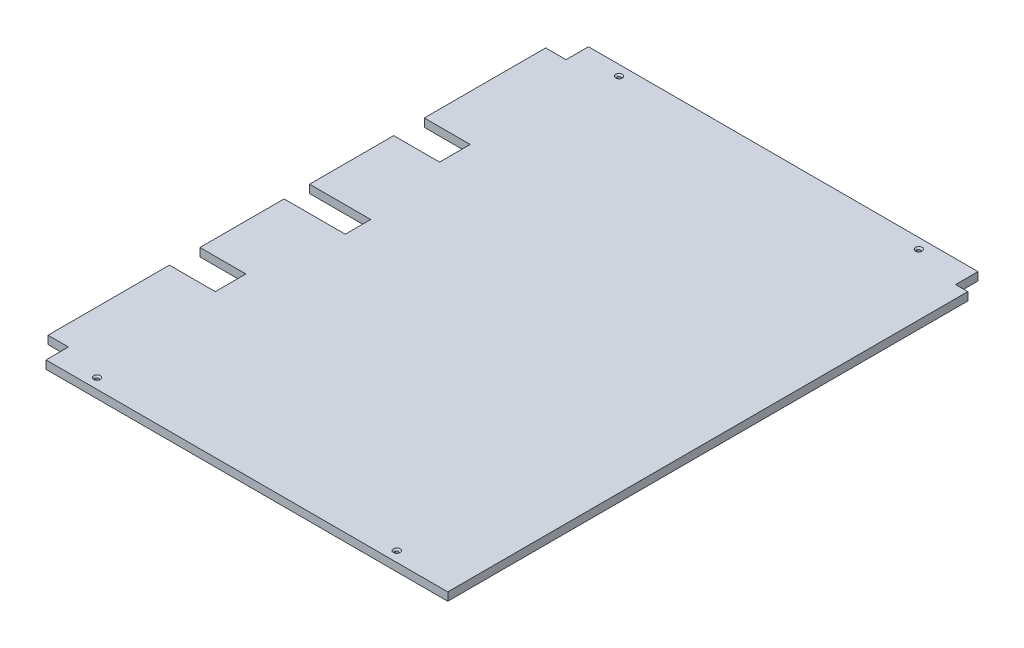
from build123d import *

# Parameters (mm, degrees)
SKIZZE1_W                        = 414
SKIZZE1_H                        = 532
AUFSATZ_LINEAR_AUSTRAGEN1_DEPTH  = 8
SKIZZE2_W                        = 20
SKIZZE2_H                        = 22
SKIZZE2_W_2                      = 12
SCHNITT_LINEAR_AUSTRAGEN1_DEPTH  = 338.148335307
SKIZZE3_W                        = 45
SKIZZE3_H                        = 30
SKIZZE3_W_2                      = 60
SKIZZE3_H_2                      = 25
SCHNITT_LINEAR_AUSTRAGEN2_DEPTH  = 338.148335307
F_3_5_3_5_DURCHMESSER_BOHRUNG1_D = 3.5
FASE1_SIZE                       = 1.5


with BuildPart() as part:
    # Skizze1 → Aufsatz-Linear austragen1 (new body)
    with BuildSketch(Plane(origin=(0, 0, 0), x_dir=(1, 0, 0), z_dir=(0, 1, 0))):
        Rectangle(SKIZZE1_W, SKIZZE1_H)
    extrude(amount=AUFSATZ_LINEAR_AUSTRAGEN1_DEPTH)

    # Skizze2 → Schnitt-Linear austragen1 (cut, through all)
    with BuildSketch(Plane(origin=(0, 8, 0), x_dir=(1, 0, 0), z_dir=(0, 1, 0))):
        with Locations((-197, -255)):
            Rectangle(SKIZZE2_W, SKIZZE2_H)
        with Locations((-197, 255)):
            Rectangle(SKIZZE2_W, SKIZZE2_H)
        with Locations((201, 255)):
            Rectangle(SKIZZE2_W_2, SKIZZE2_H)
    extrude(amount=-SCHNITT_LINEAR_AUSTRAGEN1_DEPTH, mode=Mode.SUBTRACT)

    # Skizze3 → Schnitt-Linear austragen2 (cut, through all)
    with BuildSketch(Plane(origin=(0, 8, 0), x_dir=(1, 0, 0), z_dir=(0, 1, 0))):
        with Locations((-184.5, 110)):
            Rectangle(SKIZZE3_W, SKIZZE3_H)
        with Locations((-184.5, -110)):
            Rectangle(SKIZZE3_W, SKIZZE3_H)
        with Locations((-177, 0)):
            Rectangle(SKIZZE3_W_2, SKIZZE3_H_2)
    extrude(amount=-SCHNITT_LINEAR_AUSTRAGEN2_DEPTH, mode=Mode.SUBTRACT)

    # 3.5 _3.5_ Durchmesser Bohrung1 (through all)
    with Locations(Plane(origin=(0, 8, 0), x_dir=(1, 0, 0), z_dir=(0, 1, 0))):
        with Locations((-147, -256), (147, -256), (147, 256), (-147, 256)):
            Hole(F_3_5_3_5_DURCHMESSER_BOHRUNG1_D / 2)

    # Fase1
    fase1_edges = [part.edges().sort_by_distance(p)[0] for p in [
        (-145.25, 8, -256),
        (148.75, 8, -256),
        (148.75, 8, 256),
        (-145.25, 8, 256),
    ]]
    chamfer(fase1_edges, length=FASE1_SIZE)


solid = part.part
